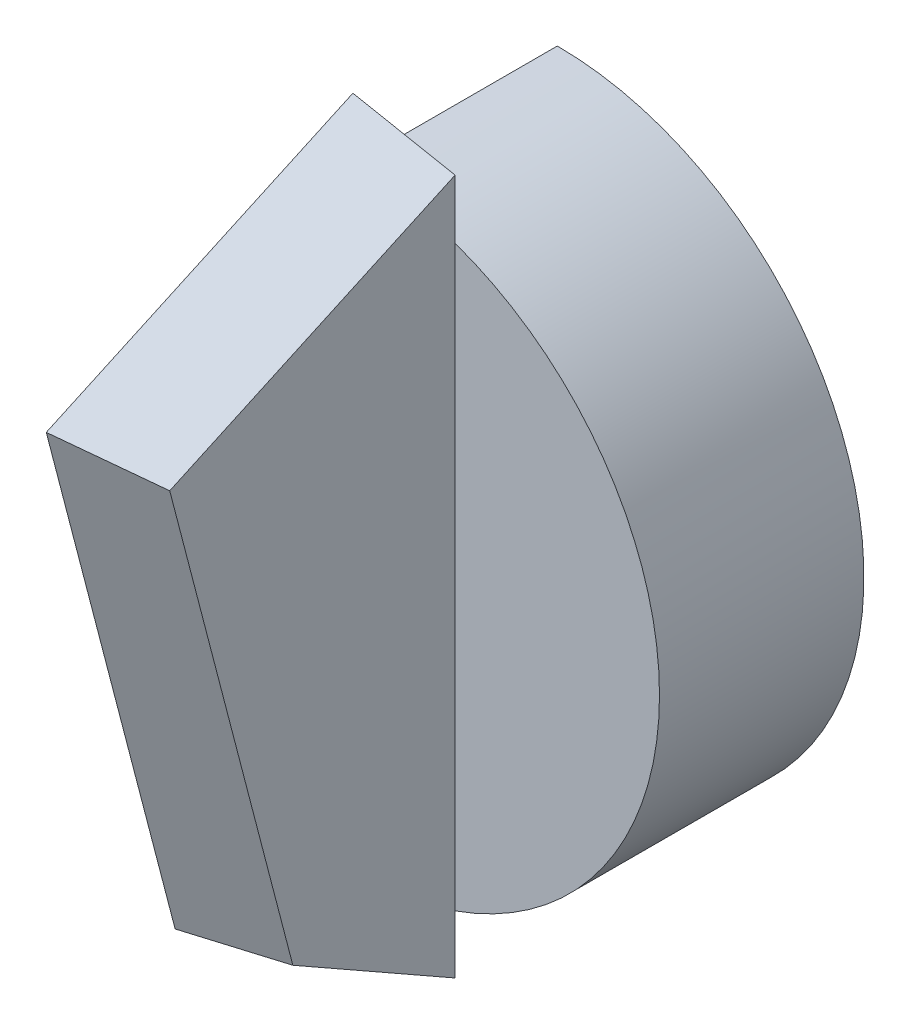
from build123d import *

# Parameters (mm, degrees)
EXTRUDE1_DEPTH = 10
EXTRUDE2_DEPTH = 5
DRAFT1_ANGLE   = 10


with BuildPart() as part:
    # Sketch1 → Extrude1 (new body)
    with BuildSketch(Plane.XY):
        with BuildLine():
            Line((0, 15), (0, -15))
            ThreePointArc((0, -15), (15, 0), (0, 15))
        make_face()
    extrude(amount=EXTRUDE1_DEPTH)

    # Sketch2 → Extrude2 (add)
    with BuildSketch(Plane(origin=(0, 0, 0), x_dir=(0, 0, -1), z_dir=(1, 0, 0))):
        Polygon((-10, 18), (-10, -18), (-18.695530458, -13.061604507), (-25, 11.130412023), align=None)
    extrude(amount=EXTRUDE2_DEPTH)

    # Draft1
    draft1_faces = [part.faces().sort_by_distance(p)[0] for p in [
        (2.5, 14.565206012, 17.5),
        (2.5, -0.965596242, 21.847765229),
        (2.5, -15.530802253, 14.347765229),
    ]]
    draft(draft1_faces, Plane(origin=(0, 0, 0), x_dir=(0, 0, 1), z_dir=(1, 0, 0)), DRAFT1_ANGLE)


solid = part.part
